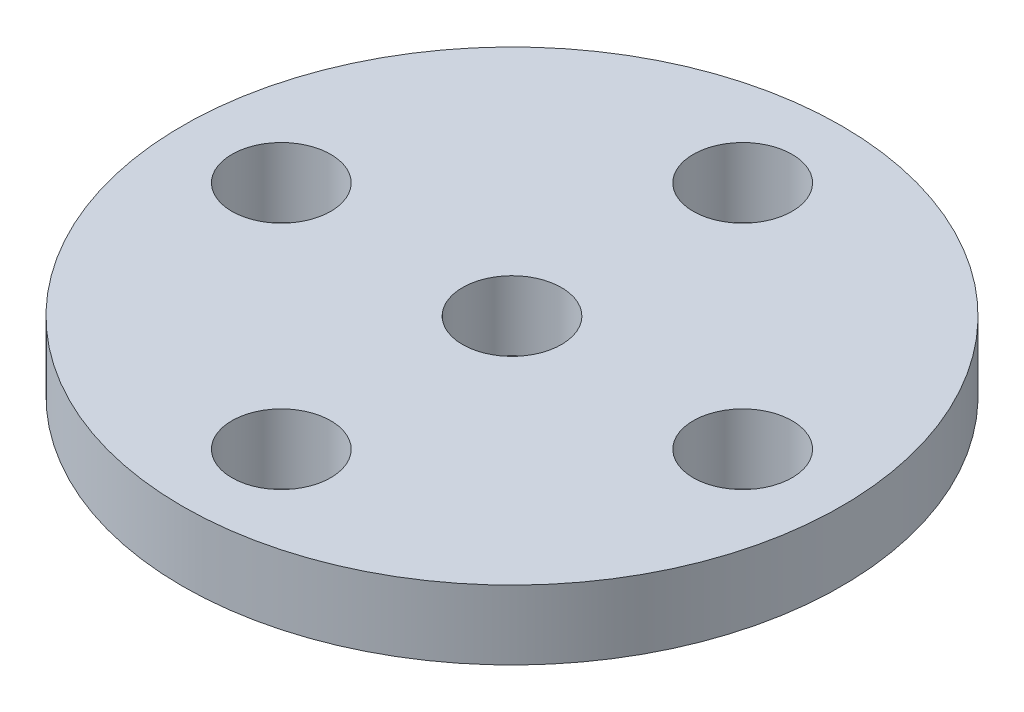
from build123d import *

# Parameters (mm, degrees)
SKETCH1_R           = 10
SKETCH1_R_2         = 1.5
BOSS_EXTRUDE1_DEPTH = 2.1


with BuildPart() as part:
    # Sketch1 → Boss-Extrude1 (new body)
    with BuildSketch(Plane(origin=(0, 0, 0), x_dir=(1, 0, 0), z_dir=(0, 1, 0))):
        with Locations(Location((0, 0, 0), (0, 0, 270))):
            Circle(SKETCH1_R)
        with Locations(Location((0, 0, 0), (0, 0, 270))):
            Circle(SKETCH1_R_2, mode=Mode.SUBTRACT)
        with Locations(Location((0, 7, 0), (0, 0, 270))):
            Circle(SKETCH1_R_2, mode=Mode.SUBTRACT)
        with Locations(Location((7, 0, 0), (0, 0, 270))):
            Circle(SKETCH1_R_2, mode=Mode.SUBTRACT)
        with Locations(Location((0, -7, 0), (0, 0, 270))):
            Circle(SKETCH1_R_2, mode=Mode.SUBTRACT)
        with Locations(Location((-7, 0, 0), (0, 0, 270))):
            Circle(SKETCH1_R_2, mode=Mode.SUBTRACT)
    extrude(amount=BOSS_EXTRUDE1_DEPTH)


solid = part.part
